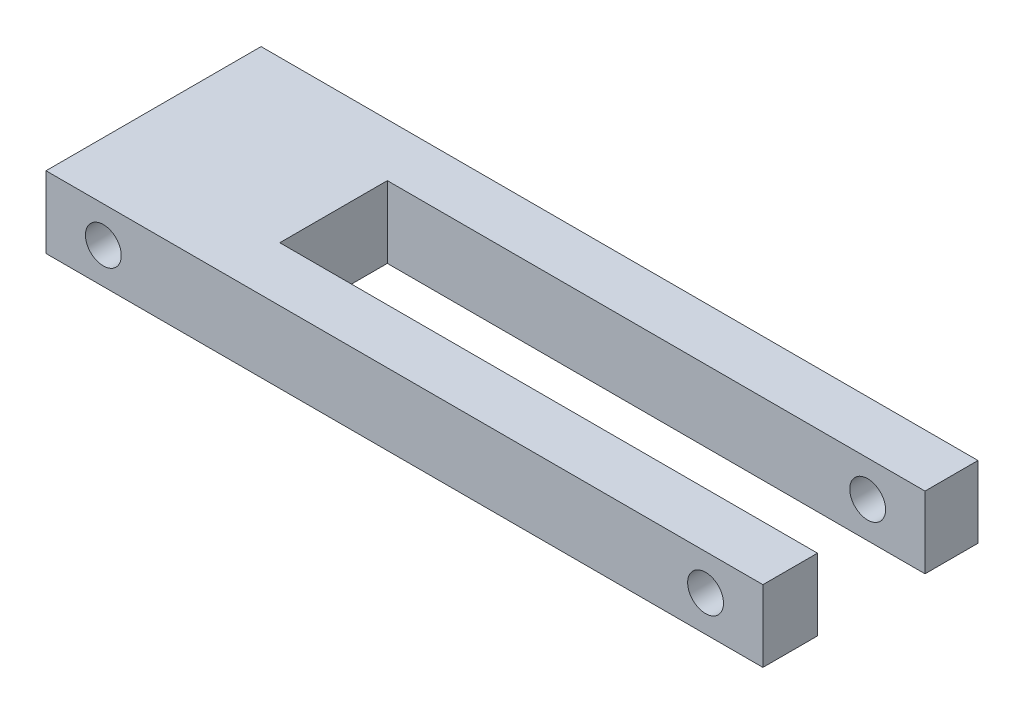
from build123d import *

# Parameters (mm, degrees)
BOSS_EXTRUDE1_DEPTH = 100
CUT_EXTRUDE1_REACH  = 593.608
SKETCH8_R           = 25


with BuildPart() as part:
    # Sketch5 → Boss-Extrude1 (new body)
    with BuildSketch(Plane(origin=(0, 0, 0), x_dir=(-1, 0, 0), z_dir=(0, -1, 0))):
        Polygon((-500, 147.792494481), (500, 147.792494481), (500, -152.207505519), (-500, -152.207505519), (-500, -76.103752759), (250, -76.103752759), (250, 73.896247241), (-500, 73.896247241), align=None)
    extrude(amount=BOSS_EXTRUDE1_DEPTH)

    # Cut-Extrude1: up to this face of the body (flat: up to its plane)
    cut_extrude1_end = Plane(part.part.faces().sort_by_distance((0, -50, 152.207505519))[0])
    # Sketch8 → Cut-Extrude1 (cut, up to the picked face)
    with BuildSketch(Plane(origin=(0, 0, -147.792494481), x_dir=(-1, 0, 0), z_dir=(0, 0, -1)), mode=Mode.PRIVATE) as cut_extrude1_sk1:
        with Locations((-420, -50)):
            Circle(SKETCH8_R)
    cut_extrude1_tool1 = split(extrude(cut_extrude1_sk1.sketch, amount=-CUT_EXTRUDE1_REACH, mode=Mode.PRIVATE), bisect_by=cut_extrude1_end, keep=Keep.BOTH, mode=Mode.PRIVATE)
    # Sketch8 → Cut-Extrude1 (cut, up to the picked face)
    with BuildSketch(Plane(origin=(0, 0, -147.792494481), x_dir=(-1, 0, 0), z_dir=(0, 0, -1)), mode=Mode.PRIVATE) as cut_extrude1_sk2:
        with Locations((420, -50)):
            Circle(SKETCH8_R)
    cut_extrude1_tool2 = split(extrude(cut_extrude1_sk2.sketch, amount=-CUT_EXTRUDE1_REACH, mode=Mode.PRIVATE), bisect_by=cut_extrude1_end, keep=Keep.BOTH, mode=Mode.PRIVATE)
    add(cut_extrude1_tool1.solids().sort_by(Axis((420, -50, -147.792494), (0, 0, 1)))[0], mode=Mode.SUBTRACT)
    add(cut_extrude1_tool2.solids().sort_by(Axis((-420, -50, -147.792494), (0, 0, 1)))[0], mode=Mode.SUBTRACT)


solid = part.part
